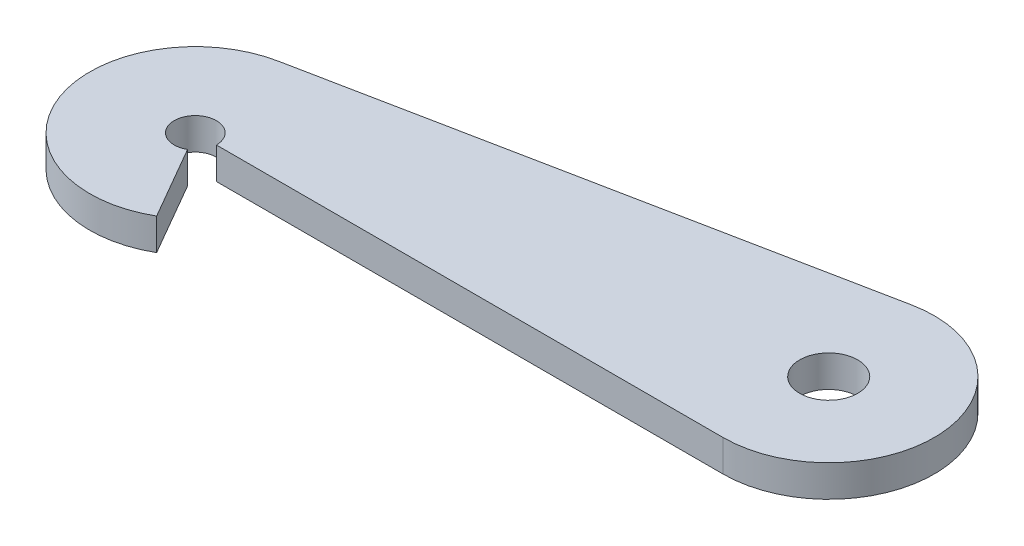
ISO-10303-21;
HEADER;
FILE_DESCRIPTION(('STEP AP214'),'2;1');
FILE_NAME('part.step','',(''),(''),'','','');
FILE_SCHEMA(('AUTOMOTIVE_DESIGN { 1 0 10303 214 1 1 1 1 }'));
ENDSEC;
DATA;
#1=APPLICATION_CONTEXT('core data for automotive mechanical design processes');
#2=APPLICATION_PROTOCOL_DEFINITION('international standard','automotive_design',2000,#1);
#3=PRODUCT_CONTEXT('',#1,'mechanical');
#4=PRODUCT('Part','Part','',(#3));
#5=PRODUCT_RELATED_PRODUCT_CATEGORY('part','',(#4));
#6=PRODUCT_DEFINITION_FORMATION('','',#4);
#7=PRODUCT_DEFINITION_CONTEXT('part definition',#1,'design');
#8=PRODUCT_DEFINITION('design','',#6,#7);
#9=PRODUCT_DEFINITION_SHAPE('','',#8);
#10=(LENGTH_UNIT() NAMED_UNIT(*) SI_UNIT(.MILLI.,.METRE.));
#11=(NAMED_UNIT(*) PLANE_ANGLE_UNIT() SI_UNIT($,.RADIAN.));
#12=(NAMED_UNIT(*) SI_UNIT($,.STERADIAN.) SOLID_ANGLE_UNIT());
#13=UNCERTAINTY_MEASURE_WITH_UNIT(LENGTH_MEASURE(1.E-05),#10,'distance_accuracy_value','');
#14=(GEOMETRIC_REPRESENTATION_CONTEXT(3) GLOBAL_UNCERTAINTY_ASSIGNED_CONTEXT((#13)) GLOBAL_UNIT_ASSIGNED_CONTEXT((#10,
#11,#12)) REPRESENTATION_CONTEXT('',''));
#15=CARTESIAN_POINT('',(0.,0.,0.));
#16=DIRECTION('',(0.,0.,1.));
#17=DIRECTION('',(1.,0.,0.));
#18=AXIS2_PLACEMENT_3D('',#15,#16,#17);
#19=CARTESIAN_POINT('',(0.,3.,0.));
#20=DIRECTION('',(0.,1.,0.));
#21=DIRECTION('',(0.,0.,1.));
#22=AXIS2_PLACEMENT_3D('',#19,#20,#21);
#23=PLANE('',#22);
#24=CARTESIAN_POINT('',(0.,3.,0.));
#25=DIRECTION('',(0.,1.,0.));
#26=DIRECTION('',(0.,0.,1.));
#27=AXIS2_PLACEMENT_3D('',#24,#25,#26);
#28=CIRCLE('',#27,10.);
#29=CARTESIAN_POINT('',(-1.96116135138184,3.,-9.8058067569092));
#30=VERTEX_POINT('',#29);
#31=CARTESIAN_POINT('',(5.00000000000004,3.,8.66025403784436));
#32=VERTEX_POINT('',#31);
#33=EDGE_CURVE('E126',#30,#32,#28,.T.);
#34=ORIENTED_EDGE('',*,*,#33,.T.);
#35=DIRECTION('',(-0.500000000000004,0.,-0.866025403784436));
#36=VECTOR('',#35,1.);
#37=CARTESIAN_POINT('',(1.00000000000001,3.,1.73205080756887));
#38=LINE('',#37,#36);
#39=CARTESIAN_POINT('',(1.00000000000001,3.,1.73205080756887));
#40=VERTEX_POINT('',#39);
#41=EDGE_CURVE('E84',#32,#40,#38,.T.);
#42=ORIENTED_EDGE('',*,*,#41,.T.);
#43=CARTESIAN_POINT('',(0.,3.,0.));
#44=DIRECTION('',(0.,-1.,0.));
#45=DIRECTION('',(0.,0.,1.));
#46=AXIS2_PLACEMENT_3D('',#43,#44,#45);
#47=CIRCLE('',#46,2.);
#48=CARTESIAN_POINT('',(2.,3.,0.));
#49=VERTEX_POINT('',#48);
#50=EDGE_CURVE('E97',#40,#49,#47,.T.);
#51=ORIENTED_EDGE('',*,*,#50,.T.);
#52=DIRECTION('',(1.,0.,0.));
#53=VECTOR('',#52,1.);
#54=CARTESIAN_POINT('',(50.,3.,0.));
#55=LINE('',#54,#53);
#56=CARTESIAN_POINT('',(50.,3.,0.));
#57=VERTEX_POINT('',#56);
#58=EDGE_CURVE('E91',#49,#57,#55,.T.);
#59=ORIENTED_EDGE('',*,*,#58,.T.);
#60=CARTESIAN_POINT('',(50.,3.,-10.));
#61=DIRECTION('',(0.,1.,0.));
#62=DIRECTION('',(0.,0.,1.));
#63=AXIS2_PLACEMENT_3D('',#60,#61,#62);
#64=CIRCLE('',#63,10.);
#65=CARTESIAN_POINT('',(48.0388386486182,3.,-19.8058067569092));
#66=VERTEX_POINT('',#65);
#67=EDGE_CURVE('E95',#57,#66,#64,.T.);
#68=ORIENTED_EDGE('',*,*,#67,.T.);
#69=DIRECTION('',(-0.98058067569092,0.,0.196116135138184));
#70=VECTOR('',#69,1.);
#71=CARTESIAN_POINT('',(48.0388386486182,3.,-19.8058067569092));
#72=LINE('',#71,#70);
#73=EDGE_CURVE('E47',#66,#30,#72,.T.);
#74=ORIENTED_EDGE('',*,*,#73,.T.);
#75=EDGE_LOOP('',(#34,#42,#51,#59,#68,#74));
#76=FACE_BOUND('',#75,.T.);
#77=CARTESIAN_POINT('',(50.,3.,-10.));
#78=DIRECTION('',(0.,1.,0.));
#79=DIRECTION('',(0.,0.,1.));
#80=AXIS2_PLACEMENT_3D('',#77,#78,#79);
#81=CIRCLE('',#80,2.75000000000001);
#82=CARTESIAN_POINT('',(50.,3.,-7.24999999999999));
#83=VERTEX_POINT('',#82);
#84=EDGE_CURVE('E119',#83,#83,#81,.T.);
#85=ORIENTED_EDGE('',*,*,#84,.F.);
#86=EDGE_LOOP('',(#85));
#87=FACE_BOUND('',#86,.T.);
#88=ADVANCED_FACE('F30',(#76,#87),#23,.T.);
#89=CARTESIAN_POINT('',(0.,0.,0.));
#90=DIRECTION('',(0.,1.,0.));
#91=DIRECTION('',(0.,0.,1.));
#92=AXIS2_PLACEMENT_3D('',#89,#90,#91);
#93=PLANE('',#92);
#94=CARTESIAN_POINT('',(0.,0.,0.));
#95=DIRECTION('',(0.,1.,0.));
#96=DIRECTION('',(0.,0.,1.));
#97=AXIS2_PLACEMENT_3D('',#94,#95,#96);
#98=CIRCLE('',#97,10.);
#99=CARTESIAN_POINT('',(-1.96116135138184,0.,-9.8058067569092));
#100=VERTEX_POINT('',#99);
#101=CARTESIAN_POINT('',(5.00000000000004,0.,8.66025403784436));
#102=VERTEX_POINT('',#101);
#103=EDGE_CURVE('E115',#100,#102,#98,.T.);
#104=ORIENTED_EDGE('',*,*,#103,.F.);
#105=DIRECTION('',(-0.98058067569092,0.,0.196116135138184));
#106=VECTOR('',#105,1.);
#107=CARTESIAN_POINT('',(48.0388386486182,0.,-19.8058067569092));
#108=LINE('',#107,#106);
#109=CARTESIAN_POINT('',(48.0388386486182,0.,-19.8058067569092));
#110=VERTEX_POINT('',#109);
#111=EDGE_CURVE('E76',#110,#100,#108,.T.);
#112=ORIENTED_EDGE('',*,*,#111,.F.);
#113=CARTESIAN_POINT('',(50.,0.,-10.));
#114=DIRECTION('',(0.,1.,0.));
#115=DIRECTION('',(0.,0.,1.));
#116=AXIS2_PLACEMENT_3D('',#113,#114,#115);
#117=CIRCLE('',#116,10.);
#118=CARTESIAN_POINT('',(50.,0.,0.));
#119=VERTEX_POINT('',#118);
#120=EDGE_CURVE('E70',#119,#110,#117,.T.);
#121=ORIENTED_EDGE('',*,*,#120,.F.);
#122=DIRECTION('',(1.,0.,0.));
#123=VECTOR('',#122,1.);
#124=CARTESIAN_POINT('',(50.,0.,0.));
#125=LINE('',#124,#123);
#126=CARTESIAN_POINT('',(2.,0.,0.));
#127=VERTEX_POINT('',#126);
#128=EDGE_CURVE('E105',#127,#119,#125,.T.);
#129=ORIENTED_EDGE('',*,*,#128,.F.);
#130=CARTESIAN_POINT('',(0.,0.,0.));
#131=DIRECTION('',(0.,-1.,0.));
#132=DIRECTION('',(0.,0.,1.));
#133=AXIS2_PLACEMENT_3D('',#130,#131,#132);
#134=CIRCLE('',#133,2.);
#135=CARTESIAN_POINT('',(1.00000000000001,0.,1.73205080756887));
#136=VERTEX_POINT('',#135);
#137=EDGE_CURVE('E121',#136,#127,#134,.T.);
#138=ORIENTED_EDGE('',*,*,#137,.F.);
#139=DIRECTION('',(-0.500000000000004,0.,-0.866025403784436));
#140=VECTOR('',#139,1.);
#141=CARTESIAN_POINT('',(1.00000000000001,0.,1.73205080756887));
#142=LINE('',#141,#140);
#143=EDGE_CURVE('E118',#102,#136,#142,.T.);
#144=ORIENTED_EDGE('',*,*,#143,.F.);
#145=EDGE_LOOP('',(#104,#112,#121,#129,#138,#144));
#146=FACE_BOUND('',#145,.T.);
#147=CARTESIAN_POINT('',(50.,0.,-10.));
#148=DIRECTION('',(0.,1.,0.));
#149=DIRECTION('',(0.,0.,1.));
#150=AXIS2_PLACEMENT_3D('',#147,#148,#149);
#151=CIRCLE('',#150,2.75000000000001);
#152=CARTESIAN_POINT('',(50.,0.,-7.24999999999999));
#153=VERTEX_POINT('',#152);
#154=EDGE_CURVE('E219',#153,#153,#151,.T.);
#155=ORIENTED_EDGE('',*,*,#154,.T.);
#156=EDGE_LOOP('',(#155));
#157=FACE_BOUND('',#156,.T.);
#158=ADVANCED_FACE('F135',(#146,#157),#93,.F.);
#159=CARTESIAN_POINT('',(0.,3.,0.));
#160=DIRECTION('',(0.,-1.,0.));
#161=DIRECTION('',(0.,0.,-1.));
#162=AXIS2_PLACEMENT_3D('',#159,#160,#161);
#163=CYLINDRICAL_SURFACE('',#162,10.);
#164=ORIENTED_EDGE('',*,*,#103,.T.);
#165=DIRECTION('',(0.,-1.,0.));
#166=VECTOR('',#165,1.);
#167=CARTESIAN_POINT('',(5.00000000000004,3.,8.66025403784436));
#168=LINE('',#167,#166);
#169=EDGE_CURVE('E11',#32,#102,#168,.T.);
#170=ORIENTED_EDGE('',*,*,#169,.F.);
#171=ORIENTED_EDGE('',*,*,#33,.F.);
#172=DIRECTION('',(0.,-1.,0.));
#173=VECTOR('',#172,1.);
#174=CARTESIAN_POINT('',(-1.96116135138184,3.,-9.8058067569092));
#175=LINE('',#174,#173);
#176=EDGE_CURVE('E111',#30,#100,#175,.T.);
#177=ORIENTED_EDGE('',*,*,#176,.T.);
#178=EDGE_LOOP('',(#164,#170,#171,#177));
#179=FACE_BOUND('',#178,.T.);
#180=ADVANCED_FACE('F32',(#179),#163,.T.);
#181=CARTESIAN_POINT('',(1.00000000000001,3.,1.73205080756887));
#182=DIRECTION('',(-0.866025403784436,0.,0.500000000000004));
#183=DIRECTION('',(0.500000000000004,0.,0.866025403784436));
#184=AXIS2_PLACEMENT_3D('',#181,#182,#183);
#185=PLANE('',#184);
#186=ORIENTED_EDGE('',*,*,#143,.T.);
#187=DIRECTION('',(0.,-1.,0.));
#188=VECTOR('',#187,1.);
#189=CARTESIAN_POINT('',(1.00000000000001,3.,1.73205080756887));
#190=LINE('',#189,#188);
#191=EDGE_CURVE('E39',#40,#136,#190,.T.);
#192=ORIENTED_EDGE('',*,*,#191,.F.);
#193=ORIENTED_EDGE('',*,*,#41,.F.);
#194=ORIENTED_EDGE('',*,*,#169,.T.);
#195=EDGE_LOOP('',(#186,#192,#193,#194));
#196=FACE_BOUND('',#195,.T.);
#197=ADVANCED_FACE('F160',(#196),#185,.F.);
#198=CARTESIAN_POINT('',(0.,3.,0.));
#199=DIRECTION('',(0.,-1.,0.));
#200=DIRECTION('',(0.,0.,-1.));
#201=AXIS2_PLACEMENT_3D('',#198,#199,#200);
#202=CYLINDRICAL_SURFACE('',#201,2.);
#203=ORIENTED_EDGE('',*,*,#137,.T.);
#204=DIRECTION('',(0.,-1.,0.));
#205=VECTOR('',#204,1.);
#206=CARTESIAN_POINT('',(2.,3.,0.));
#207=LINE('',#206,#205);
#208=EDGE_CURVE('E106',#49,#127,#207,.T.);
#209=ORIENTED_EDGE('',*,*,#208,.F.);
#210=ORIENTED_EDGE('',*,*,#50,.F.);
#211=ORIENTED_EDGE('',*,*,#191,.T.);
#212=EDGE_LOOP('',(#203,#209,#210,#211));
#213=FACE_BOUND('',#212,.T.);
#214=ADVANCED_FACE('F132',(#213),#202,.F.);
#215=CARTESIAN_POINT('',(50.,3.,0.));
#216=DIRECTION('',(0.,0.,-1.));
#217=DIRECTION('',(-1.,0.,0.));
#218=AXIS2_PLACEMENT_3D('',#215,#216,#217);
#219=PLANE('',#218);
#220=ORIENTED_EDGE('',*,*,#128,.T.);
#221=DIRECTION('',(0.,-1.,0.));
#222=VECTOR('',#221,1.);
#223=CARTESIAN_POINT('',(50.,3.,0.));
#224=LINE('',#223,#222);
#225=EDGE_CURVE('E102',#57,#119,#224,.T.);
#226=ORIENTED_EDGE('',*,*,#225,.F.);
#227=ORIENTED_EDGE('',*,*,#58,.F.);
#228=ORIENTED_EDGE('',*,*,#208,.T.);
#229=EDGE_LOOP('',(#220,#226,#227,#228));
#230=FACE_BOUND('',#229,.T.);
#231=ADVANCED_FACE('F103',(#230),#219,.F.);
#232=CARTESIAN_POINT('',(50.,3.,-10.));
#233=DIRECTION('',(0.,-1.,0.));
#234=DIRECTION('',(0.,0.,-1.));
#235=AXIS2_PLACEMENT_3D('',#232,#233,#234);
#236=CYLINDRICAL_SURFACE('',#235,10.);
#237=ORIENTED_EDGE('',*,*,#120,.T.);
#238=DIRECTION('',(0.,-1.,0.));
#239=VECTOR('',#238,1.);
#240=CARTESIAN_POINT('',(48.0388386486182,3.,-19.8058067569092));
#241=LINE('',#240,#239);
#242=EDGE_CURVE('E107',#66,#110,#241,.T.);
#243=ORIENTED_EDGE('',*,*,#242,.F.);
#244=ORIENTED_EDGE('',*,*,#67,.F.);
#245=ORIENTED_EDGE('',*,*,#225,.T.);
#246=EDGE_LOOP('',(#237,#243,#244,#245));
#247=FACE_BOUND('',#246,.T.);
#248=ADVANCED_FACE('F109',(#247),#236,.T.);
#249=CARTESIAN_POINT('',(48.0388386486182,3.,-19.8058067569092));
#250=DIRECTION('',(0.196116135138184,0.,0.98058067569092));
#251=DIRECTION('',(0.98058067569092,0.,-0.196116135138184));
#252=AXIS2_PLACEMENT_3D('',#249,#250,#251);
#253=PLANE('',#252);
#254=ORIENTED_EDGE('',*,*,#111,.T.);
#255=ORIENTED_EDGE('',*,*,#176,.F.);
#256=ORIENTED_EDGE('',*,*,#73,.F.);
#257=ORIENTED_EDGE('',*,*,#242,.T.);
#258=EDGE_LOOP('',(#254,#255,#256,#257));
#259=FACE_BOUND('',#258,.T.);
#260=ADVANCED_FACE('F140',(#259),#253,.F.);
#261=CARTESIAN_POINT('',(50.,3.,-10.));
#262=DIRECTION('',(0.,-1.,0.));
#263=DIRECTION('',(0.,0.,-1.));
#264=AXIS2_PLACEMENT_3D('',#261,#262,#263);
#265=CYLINDRICAL_SURFACE('',#264,2.75000000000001);
#266=ORIENTED_EDGE('',*,*,#84,.T.);
#267=EDGE_LOOP('',(#266));
#268=FACE_BOUND('',#267,.T.);
#269=ORIENTED_EDGE('',*,*,#154,.F.);
#270=EDGE_LOOP('',(#269));
#271=FACE_BOUND('',#270,.T.);
#272=ADVANCED_FACE('F142',(#268,#271),#265,.F.);
#273=CLOSED_SHELL('',(#88,#158,#180,#197,#214,#231,#248,#260,#272));
#274=MANIFOLD_SOLID_BREP('B2',#273);
#275=ADVANCED_BREP_SHAPE_REPRESENTATION('',(#18,#274),#14);
#276=SHAPE_DEFINITION_REPRESENTATION(#9,#275);
ENDSEC;
END-ISO-10303-21;
